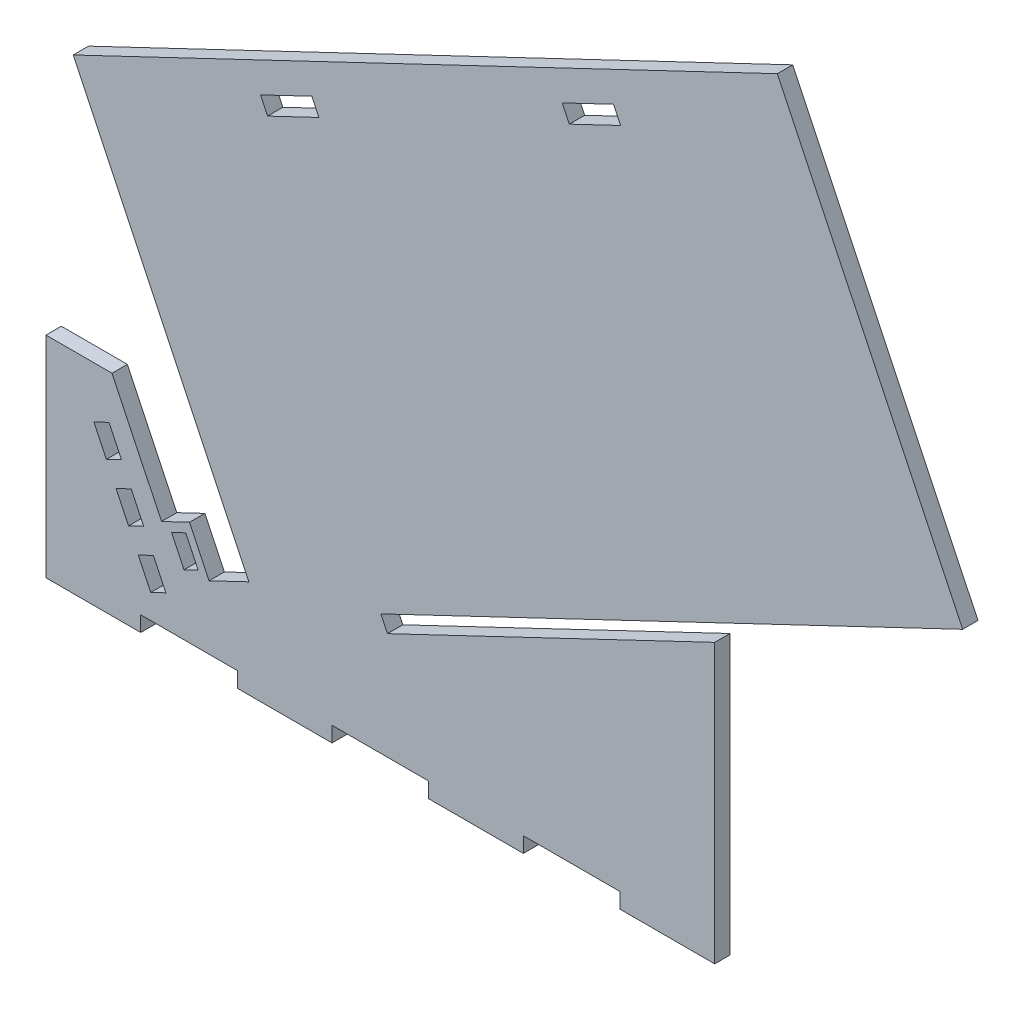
from build123d import *

# Parameters (mm, degrees)
BOSS_EXTRUDE1_DEPTH = 5.5


with BuildPart() as part:
    # Sketch1 → Boss-Extrude1 (new body)
    with BuildSketch(Plane.XY):
        Polygon((-264.257200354, -90.158072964), (-264.257200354, -95.658072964), (-230.257200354, -95.658072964), (-230.257200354, -90.158072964), (-195.597200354, -90.158072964), (-195.597200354, -95.658072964), (-161.597200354, -95.658072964), (-161.597200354, -90.158072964), (-126.917200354, -90.158072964), (-126.917200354, -95.658072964), (-92.917200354, -95.658072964), (-92.917200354, -90.158072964), (-58.257200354, -90.158072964), (-58.257200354, -95.658072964), (-24.257200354, -95.658072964), (-24.257200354, -90.158072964), (-24.257200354, 4.28308251), (-141.707906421, -51.738030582), (-144.075717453, -46.773811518), (64.743830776, 52.828003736), (-1.770133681, 192.277430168), (-254.494013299, 71.734323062), (-191.425180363, -60.492234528), (-205.727558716, -67.314119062), (-212.73562074, -52.621411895), (-222.803045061, -57.423326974), (-240.553810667, -20.208072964), (-264.257200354, -20.208072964), align=None)
        Polygon((-226.65672616, -81.398839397), (-231.134041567, -72.01195244), (-225.718529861, -69.428885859), (-221.241214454, -78.815772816), align=None, mode=Mode.SUBTRACT)
        Polygon((-214.729005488, -68.418450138), (-219.206320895, -59.031563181), (-214.151843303, -56.620701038), (-209.674527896, -66.007587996), align=None, mode=Mode.SUBTRACT)
        Polygon((-233.682985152, -52.731058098), (-229.205669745, -62.117945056), (-234.621181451, -64.701011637), (-239.098496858, -55.314124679), align=None, mode=Mode.SUBTRACT)
        Polygon((-241.647440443, -36.033230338), (-237.170125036, -45.420117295), (-242.585636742, -48.003183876), (-247.062952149, -38.616296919), align=None, mode=Mode.SUBTRACT)
        Polygon((-168.861811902, 101.721088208), (-166.321796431, 96.39583503), (-184.734536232, 87.613408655), (-187.274551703, 92.938661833), align=None, mode=Mode.SUBTRACT)
        Polygon((-60.55157778, 153.382419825), (-58.011562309, 148.057166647), (-76.42430211, 139.274740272), (-78.964317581, 144.59999345), align=None, mode=Mode.SUBTRACT)
    extrude(amount=BOSS_EXTRUDE1_DEPTH)


solid = part.part
